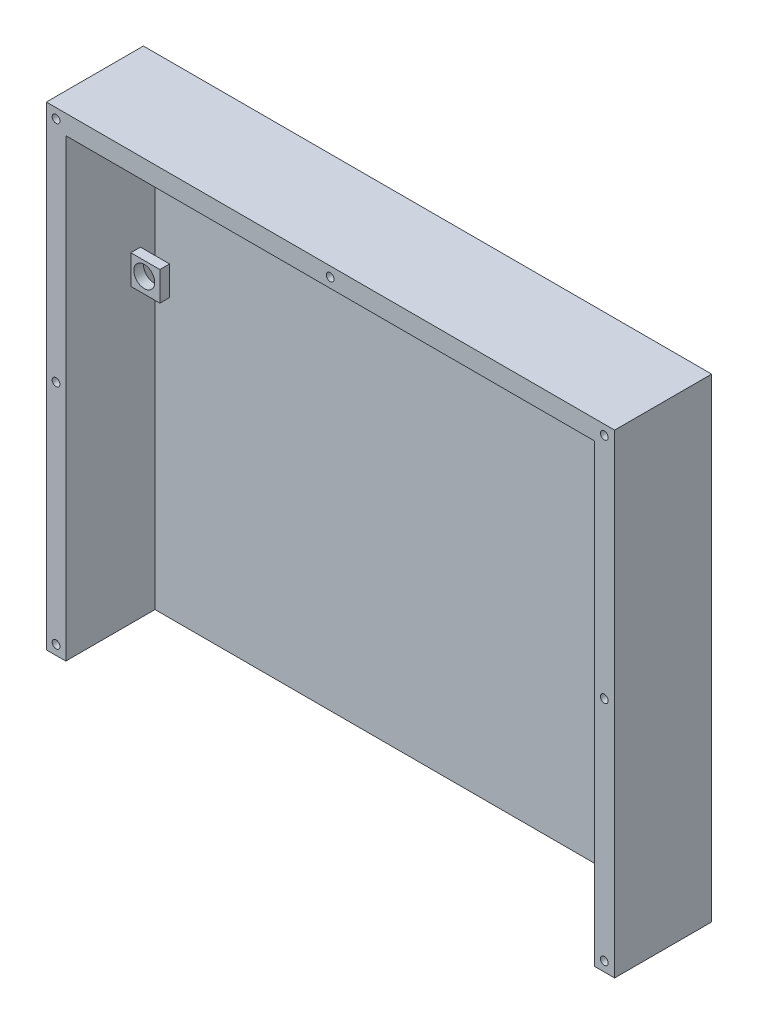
from build123d import *

# Parameters (mm, degrees)
SKETCH1_W              = 585.633745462
SKETCH1_H              = 489
BOSS_EXTRUDE1_DEPTH    = 100
SKETCH2_W              = 515
SKETCH2_H              = 469
CUT_EXTRUDE1_DEPTH     = 92
SKETCH4_W              = 92
SKETCH4_H              = 138
SKETCH4_H_2            = 301
BASE_PIVOT_CUT_1_DEPTH = 30
SKETCH5_W              = 15
SKETCH5_H              = 30
SKETCH5_W_2            = 67
BASE_PIVOT_CUT_2_DEPTH = 30
SKETCH6_R              = 10.792296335
BASE_PIVOT_CUT_3_DEPTH = 10
SKETCH7_R              = 4
CUT_EXTRUDE6_DEPTH     = 770.472471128
SKETCH8_R              = 6
CUT_EXTRUDE7_DEPTH     = 4


with BuildPart() as part:
    # Sketch1 → Boss-Extrude1 (new body)
    with BuildSketch(Plane.XY):
        with Locations((292.816872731, 244.5)):
            Rectangle(SKETCH1_W, SKETCH1_H)
    extrude(amount=BOSS_EXTRUDE1_DEPTH)

    # Sketch2 → Cut-Extrude1 (cut)
    with BuildSketch(Plane.XY.offset(100)):
        with Locations((307.5, 234.5)):
            Rectangle(SKETCH2_W, SKETCH2_H)
    extrude(amount=-CUT_EXTRUDE1_DEPTH, mode=Mode.SUBTRACT)

    # Sketch4 → Base pivot cut 1 (cut)
    with BuildSketch(Plane(origin=(50, 0, 0), x_dir=(0, 0, -1), z_dir=(1, 0, 0))):
        with Locations((-54, 400)):
            Rectangle(SKETCH4_W, SKETCH4_H)
        with Locations((-54, 150.5)):
            Rectangle(SKETCH4_W, SKETCH4_H_2)
    extrude(amount=-BASE_PIVOT_CUT_1_DEPTH, mode=Mode.SUBTRACT)

    # Sketch5 → Base pivot cut 2 (cut)
    with BuildSketch(Plane(origin=(50, 0, 0), x_dir=(0, 0, -1), z_dir=(1, 0, 0))):
        with Locations((-15.5, 316)):
            Rectangle(SKETCH5_W, SKETCH5_H)
        with Locations((-66.5, 316)):
            Rectangle(SKETCH5_W_2, SKETCH5_H)
    extrude(amount=-BASE_PIVOT_CUT_2_DEPTH, mode=Mode.SUBTRACT)

    # Sketch6 → Base pivot cut 3 (cut)
    with BuildSketch(Plane.XY.offset(33)):
        with Locations((33.911632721, 316.7469827)):
            Circle(SKETCH6_R)
    extrude(amount=-BASE_PIVOT_CUT_3_DEPTH, mode=Mode.SUBTRACT)

    # Sketch7 → Cut-Extrude6 (cut, through all)
    with BuildSketch(Plane.XY.offset(100)):
        with Locations((10, 479)):
            Circle(SKETCH7_R)
        with Locations((575, 479)):
            Circle(SKETCH7_R)
        with Locations((10, 10)):
            Circle(SKETCH7_R)
        with Locations((575, 10)):
            Circle(SKETCH7_R)
        with Locations((10, 244)):
            Circle(SKETCH7_R)
        with Locations((575, 244)):
            Circle(SKETCH7_R)
        with Locations((292.5, 479)):
            Circle(SKETCH7_R)
    extrude(amount=-CUT_EXTRUDE6_DEPTH, mode=Mode.SUBTRACT)

    # Sketch8 → Cut-Extrude7 (cut)
    with BuildSketch(Plane(origin=(0, 0, 0), x_dir=(-1, 0, 0), z_dir=(0, 0, -1))):
        with Locations((-575, 479)):
            Circle(SKETCH8_R)
        with Locations((-292.5, 479)):
            Circle(SKETCH8_R)
        with Locations((-10, 479)):
            Circle(SKETCH8_R)
        with Locations((-575, 244)):
            Circle(SKETCH8_R)
        with Locations((-575, 10)):
            Circle(SKETCH8_R)
        with Locations((-10, 244)):
            Circle(SKETCH8_R)
        with Locations((-10, 10)):
            Circle(SKETCH8_R)
    extrude(amount=-CUT_EXTRUDE7_DEPTH, mode=Mode.SUBTRACT)


solid = part.part
